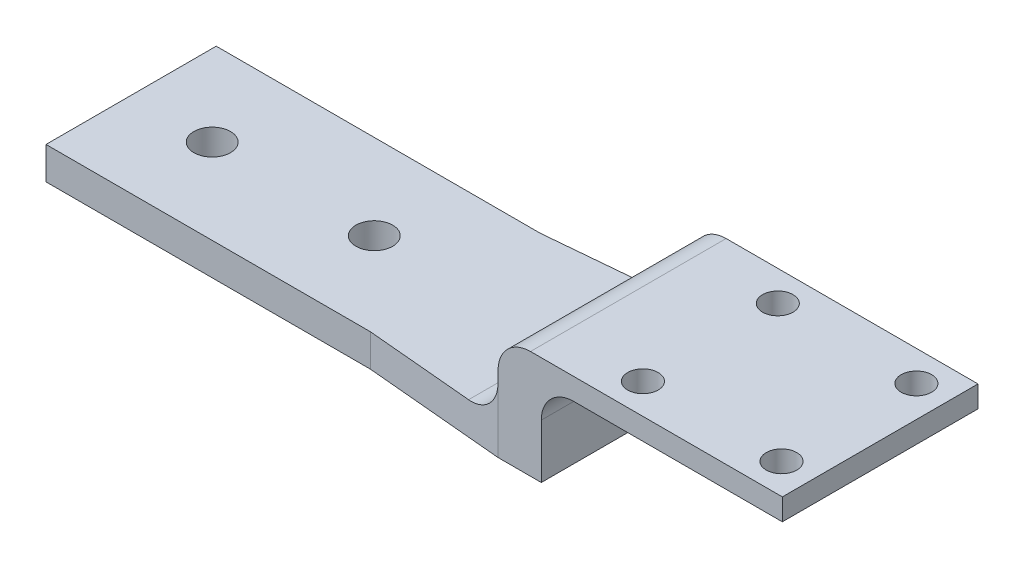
ISO-10303-21;
HEADER;
FILE_DESCRIPTION(('STEP AP214'),'2;1');
FILE_NAME('part.step','',(''),(''),'','','');
FILE_SCHEMA(('AUTOMOTIVE_DESIGN { 1 0 10303 214 1 1 1 1 }'));
ENDSEC;
DATA;
#1=APPLICATION_CONTEXT('core data for automotive mechanical design processes');
#2=APPLICATION_PROTOCOL_DEFINITION('international standard','automotive_design',2000,#1);
#3=PRODUCT_CONTEXT('',#1,'mechanical');
#4=PRODUCT('Part','Part','',(#3));
#5=PRODUCT_RELATED_PRODUCT_CATEGORY('part','',(#4));
#6=PRODUCT_DEFINITION_FORMATION('','',#4);
#7=PRODUCT_DEFINITION_CONTEXT('part definition',#1,'design');
#8=PRODUCT_DEFINITION('design','',#6,#7);
#9=PRODUCT_DEFINITION_SHAPE('','',#8);
#10=(LENGTH_UNIT() NAMED_UNIT(*) SI_UNIT(.MILLI.,.METRE.));
#11=(NAMED_UNIT(*) PLANE_ANGLE_UNIT() SI_UNIT($,.RADIAN.));
#12=(NAMED_UNIT(*) SI_UNIT($,.STERADIAN.) SOLID_ANGLE_UNIT());
#13=UNCERTAINTY_MEASURE_WITH_UNIT(LENGTH_MEASURE(1.E-05),#10,'distance_accuracy_value','');
#14=(GEOMETRIC_REPRESENTATION_CONTEXT(3) GLOBAL_UNCERTAINTY_ASSIGNED_CONTEXT((#13)) GLOBAL_UNIT_ASSIGNED_CONTEXT((#10,
#11,#12)) REPRESENTATION_CONTEXT('',''));
#15=CARTESIAN_POINT('',(0.,0.,0.));
#16=DIRECTION('',(0.,0.,1.));
#17=DIRECTION('',(1.,0.,0.));
#18=AXIS2_PLACEMENT_3D('',#15,#16,#17);
#19=CARTESIAN_POINT('',(59.69,1.905,0.));
#20=DIRECTION('',(1.,0.,0.));
#21=DIRECTION('',(0.,0.,-1.));
#22=AXIS2_PLACEMENT_3D('',#19,#20,#21);
#23=PLANE('',#22);
#24=DIRECTION('',(0.,-1.,0.));
#25=VECTOR('',#24,1.);
#26=CARTESIAN_POINT('',(59.69,1.90499999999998,-21.4935));
#27=LINE('',#26,#25);
#28=CARTESIAN_POINT('',(59.69,4.445,-21.4935));
#29=VERTEX_POINT('',#28);
#30=CARTESIAN_POINT('',(59.69,-1.90500000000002,-21.4935));
#31=VERTEX_POINT('',#30);
#32=EDGE_CURVE('E236',#29,#31,#27,.T.);
#33=ORIENTED_EDGE('',*,*,#32,.F.);
#34=DIRECTION('',(0.,0.,1.));
#35=VECTOR('',#34,1.);
#36=CARTESIAN_POINT('',(59.69,4.445,0.));
#37=LINE('',#36,#35);
#38=CARTESIAN_POINT('',(59.69,4.445,1.4935));
#39=VERTEX_POINT('',#38);
#40=EDGE_CURVE('E309',#29,#39,#37,.T.);
#41=ORIENTED_EDGE('',*,*,#40,.T.);
#42=DIRECTION('',(0.,-1.,0.));
#43=VECTOR('',#42,1.);
#44=CARTESIAN_POINT('',(59.69,1.90500000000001,1.4935));
#45=LINE('',#44,#43);
#46=CARTESIAN_POINT('',(59.69,-1.90499999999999,1.49350000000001));
#47=VERTEX_POINT('',#46);
#48=EDGE_CURVE('E233',#39,#47,#45,.T.);
#49=ORIENTED_EDGE('',*,*,#48,.T.);
#50=DIRECTION('',(0.,0.,1.));
#51=VECTOR('',#50,1.);
#52=CARTESIAN_POINT('',(59.69,-1.90499999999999,0.));
#53=LINE('',#52,#51);
#54=EDGE_CURVE('E223',#31,#47,#53,.T.);
#55=ORIENTED_EDGE('',*,*,#54,.F.);
#56=EDGE_LOOP('',(#33,#41,#49,#55));
#57=FACE_BOUND('',#56,.T.);
#58=ADVANCED_FACE('F45',(#57),#23,.T.);
#59=CARTESIAN_POINT('',(38.1,1.905,-20.));
#60=DIRECTION('',(0.,0.,-1.));
#61=DIRECTION('',(0.,1.,0.));
#62=AXIS2_PLACEMENT_3D('',#59,#60,#61);
#63=PLANE('',#62);
#64=DIRECTION('',(0.,-1.,0.));
#65=VECTOR('',#64,1.);
#66=CARTESIAN_POINT('',(0.,1.905,-20.));
#67=LINE('',#66,#65);
#68=CARTESIAN_POINT('',(0.,1.905,-20.));
#69=VERTEX_POINT('',#68);
#70=CARTESIAN_POINT('',(0.,-1.905,-20.));
#71=VERTEX_POINT('',#70);
#72=EDGE_CURVE('E255',#69,#71,#67,.T.);
#73=ORIENTED_EDGE('',*,*,#72,.F.);
#74=DIRECTION('',(-1.,0.,0.));
#75=VECTOR('',#74,1.);
#76=CARTESIAN_POINT('',(38.1,1.905,-20.));
#77=LINE('',#76,#75);
#78=CARTESIAN_POINT('',(38.1,1.905,-20.));
#79=VERTEX_POINT('',#78);
#80=EDGE_CURVE('E280',#79,#69,#77,.T.);
#81=ORIENTED_EDGE('',*,*,#80,.F.);
#82=DIRECTION('',(0.,-1.,0.));
#83=VECTOR('',#82,1.);
#84=CARTESIAN_POINT('',(38.1,1.905,-20.));
#85=LINE('',#84,#83);
#86=CARTESIAN_POINT('',(38.1,-1.905,-20.));
#87=VERTEX_POINT('',#86);
#88=EDGE_CURVE('E254',#79,#87,#85,.T.);
#89=ORIENTED_EDGE('',*,*,#88,.T.);
#90=DIRECTION('',(-1.,0.,0.));
#91=VECTOR('',#90,1.);
#92=CARTESIAN_POINT('',(38.1,-1.905,-20.));
#93=LINE('',#92,#91);
#94=EDGE_CURVE('E275',#87,#71,#93,.T.);
#95=ORIENTED_EDGE('',*,*,#94,.T.);
#96=EDGE_LOOP('',(#73,#81,#89,#95));
#97=FACE_BOUND('',#96,.T.);
#98=ADVANCED_FACE('F362',(#97),#63,.T.);
#99=CARTESIAN_POINT('',(38.1,1.905,0.));
#100=DIRECTION('',(0.,1.,0.));
#101=DIRECTION('',(0.,0.,1.));
#102=AXIS2_PLACEMENT_3D('',#99,#100,#101);
#103=PLANE('',#102);
#104=DIRECTION('',(0.995933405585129,0.,0.0900924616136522));
#105=VECTOR('',#104,1.);
#106=CARTESIAN_POINT('',(0.309244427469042,1.905,-3.41856410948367));
#107=LINE('',#106,#105);
#108=CARTESIAN_POINT('',(38.1,1.905,0.));
#109=VERTEX_POINT('',#108);
#110=CARTESIAN_POINT('',(50.8,1.90500000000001,1.14884615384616));
#111=VERTEX_POINT('',#110);
#112=EDGE_CURVE('E205',#109,#111,#107,.T.);
#113=ORIENTED_EDGE('',*,*,#112,.T.);
#114=DIRECTION('',(0.,0.,1.));
#115=VECTOR('',#114,1.);
#116=CARTESIAN_POINT('',(50.8,1.905,0.));
#117=LINE('',#116,#115);
#118=CARTESIAN_POINT('',(50.8,1.90499999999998,-21.1488461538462));
#119=VERTEX_POINT('',#118);
#120=EDGE_CURVE('E332',#111,#119,#117,.F.);
#121=ORIENTED_EDGE('',*,*,#120,.T.);
#122=DIRECTION('',(0.995933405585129,0.,-0.0900924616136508));
#123=VECTOR('',#122,1.);
#124=CARTESIAN_POINT('',(-1.48527741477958,1.90499999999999,-16.4191028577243));
#125=LINE('',#124,#123);
#126=EDGE_CURVE('E208',#79,#119,#125,.T.);
#127=ORIENTED_EDGE('',*,*,#126,.F.);
#128=ORIENTED_EDGE('',*,*,#80,.T.);
#129=DIRECTION('',(0.,0.,-1.));
#130=VECTOR('',#129,1.);
#131=CARTESIAN_POINT('',(0.,1.905,0.));
#132=LINE('',#131,#130);
#133=CARTESIAN_POINT('',(0.,1.905,0.));
#134=VERTEX_POINT('',#133);
#135=EDGE_CURVE('E268',#134,#69,#132,.T.);
#136=ORIENTED_EDGE('',*,*,#135,.F.);
#137=DIRECTION('',(-1.,0.,0.));
#138=VECTOR('',#137,1.);
#139=CARTESIAN_POINT('',(38.1,1.905,0.));
#140=LINE('',#139,#138);
#141=EDGE_CURVE('E283',#109,#134,#140,.T.);
#142=ORIENTED_EDGE('',*,*,#141,.F.);
#143=EDGE_LOOP('',(#113,#121,#127,#128,#136,#142));
#144=FACE_BOUND('',#143,.T.);
#145=CARTESIAN_POINT('',(28.575,1.905,-10.));
#146=DIRECTION('',(0.,1.,0.));
#147=DIRECTION('',(0.,0.,1.));
#148=AXIS2_PLACEMENT_3D('',#145,#146,#147);
#149=CIRCLE('',#148,2.15702401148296);
#150=CARTESIAN_POINT('',(28.575,1.905,-7.84297598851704));
#151=VERTEX_POINT('',#150);
#152=EDGE_CURVE('E244',#151,#151,#149,.T.);
#153=ORIENTED_EDGE('',*,*,#152,.F.);
#154=EDGE_LOOP('',(#153));
#155=FACE_BOUND('',#154,.T.);
#156=CARTESIAN_POINT('',(9.525,1.905,-10.));
#157=DIRECTION('',(0.,1.,0.));
#158=DIRECTION('',(0.,0.,1.));
#159=AXIS2_PLACEMENT_3D('',#156,#157,#158);
#160=CIRCLE('',#159,2.15702401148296);
#161=CARTESIAN_POINT('',(9.525,1.905,-7.84297598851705));
#162=VERTEX_POINT('',#161);
#163=EDGE_CURVE('E249',#162,#162,#160,.T.);
#164=ORIENTED_EDGE('',*,*,#163,.F.);
#165=EDGE_LOOP('',(#164));
#166=FACE_BOUND('',#165,.T.);
#167=ADVANCED_FACE('F367',(#144,#155,#166),#103,.T.);
#168=CARTESIAN_POINT('',(38.1,1.905,0.));
#169=DIRECTION('',(0.,0.,-1.));
#170=DIRECTION('',(0.,1.,0.));
#171=AXIS2_PLACEMENT_3D('',#168,#169,#170);
#172=PLANE('',#171);
#173=DIRECTION('',(0.,-1.,0.));
#174=VECTOR('',#173,1.);
#175=CARTESIAN_POINT('',(0.,1.905,0.));
#176=LINE('',#175,#174);
#177=CARTESIAN_POINT('',(0.,-1.90499999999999,0.));
#178=VERTEX_POINT('',#177);
#179=EDGE_CURVE('E264',#134,#178,#176,.T.);
#180=ORIENTED_EDGE('',*,*,#179,.T.);
#181=DIRECTION('',(-1.,0.,0.));
#182=VECTOR('',#181,1.);
#183=CARTESIAN_POINT('',(38.1,-1.90499999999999,0.));
#184=LINE('',#183,#182);
#185=CARTESIAN_POINT('',(38.1,-1.90499999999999,0.));
#186=VERTEX_POINT('',#185);
#187=EDGE_CURVE('E259',#186,#178,#184,.T.);
#188=ORIENTED_EDGE('',*,*,#187,.F.);
#189=DIRECTION('',(0.,-1.,0.));
#190=VECTOR('',#189,1.);
#191=CARTESIAN_POINT('',(38.1,1.905,0.));
#192=LINE('',#191,#190);
#193=EDGE_CURVE('E250',#109,#186,#192,.T.);
#194=ORIENTED_EDGE('',*,*,#193,.F.);
#195=ORIENTED_EDGE('',*,*,#141,.T.);
#196=EDGE_LOOP('',(#180,#188,#194,#195));
#197=FACE_BOUND('',#196,.T.);
#198=ADVANCED_FACE('F408',(#197),#172,.F.);
#199=CARTESIAN_POINT('',(38.1,-1.905,-4.91999999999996));
#200=DIRECTION('',(0.,-1.,0.));
#201=DIRECTION('',(0.,0.,-1.));
#202=AXIS2_PLACEMENT_3D('',#199,#200,#201);
#203=PLANE('',#202);
#204=CARTESIAN_POINT('',(9.525,-1.90500000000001,-10.));
#205=DIRECTION('',(0.,-1.,0.));
#206=DIRECTION('',(0.,0.,-1.));
#207=AXIS2_PLACEMENT_3D('',#204,#205,#206);
#208=CIRCLE('',#207,3.21475100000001);
#209=CARTESIAN_POINT('',(9.525,-1.90500000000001,-13.214751));
#210=VERTEX_POINT('',#209);
#211=EDGE_CURVE('E301',#210,#210,#208,.F.);
#212=ORIENTED_EDGE('',*,*,#211,.T.);
#213=EDGE_LOOP('',(#212));
#214=FACE_BOUND('',#213,.T.);
#215=CARTESIAN_POINT('',(28.575,-1.90500000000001,-10.));
#216=DIRECTION('',(0.,-1.,0.));
#217=DIRECTION('',(0.,0.,-1.));
#218=AXIS2_PLACEMENT_3D('',#215,#216,#217);
#219=CIRCLE('',#218,3.21475100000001);
#220=CARTESIAN_POINT('',(28.575,-1.90500000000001,-13.214751));
#221=VERTEX_POINT('',#220);
#222=EDGE_CURVE('E297',#221,#221,#219,.F.);
#223=ORIENTED_EDGE('',*,*,#222,.T.);
#224=EDGE_LOOP('',(#223));
#225=FACE_BOUND('',#224,.T.);
#226=DIRECTION('',(0.,0.,1.));
#227=VECTOR('',#226,1.);
#228=CARTESIAN_POINT('',(0.,-1.905,-4.91999999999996));
#229=LINE('',#228,#227);
#230=EDGE_CURVE('E260',#71,#178,#229,.T.);
#231=ORIENTED_EDGE('',*,*,#230,.F.);
#232=ORIENTED_EDGE('',*,*,#94,.F.);
#233=DIRECTION('',(0.995933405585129,0.,-0.0900924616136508));
#234=VECTOR('',#233,1.);
#235=CARTESIAN_POINT('',(-1.48527741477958,-1.90500000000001,-16.4191028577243));
#236=LINE('',#235,#234);
#237=CARTESIAN_POINT('',(54.61,-1.90500000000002,-21.4935));
#238=VERTEX_POINT('',#237);
#239=EDGE_CURVE('E215',#87,#238,#236,.T.);
#240=ORIENTED_EDGE('',*,*,#239,.T.);
#241=DIRECTION('',(1.,0.,0.));
#242=VECTOR('',#241,1.);
#243=CARTESIAN_POINT('',(0.,-1.90500000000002,-21.4935));
#244=LINE('',#243,#242);
#245=EDGE_CURVE('E219',#238,#31,#244,.T.);
#246=ORIENTED_EDGE('',*,*,#245,.T.);
#247=ORIENTED_EDGE('',*,*,#54,.T.);
#248=DIRECTION('',(-1.,0.,0.));
#249=VECTOR('',#248,1.);
#250=CARTESIAN_POINT('',(0.,-1.90499999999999,1.49350000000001));
#251=LINE('',#250,#249);
#252=CARTESIAN_POINT('',(54.61,-1.90499999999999,1.49350000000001));
#253=VERTEX_POINT('',#252);
#254=EDGE_CURVE('E209',#47,#253,#251,.T.);
#255=ORIENTED_EDGE('',*,*,#254,.T.);
#256=DIRECTION('',(0.995933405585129,0.,0.0900924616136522));
#257=VECTOR('',#256,1.);
#258=CARTESIAN_POINT('',(0.309244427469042,-1.905,-3.41856410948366));
#259=LINE('',#258,#257);
#260=EDGE_CURVE('E204',#186,#253,#259,.T.);
#261=ORIENTED_EDGE('',*,*,#260,.F.);
#262=ORIENTED_EDGE('',*,*,#187,.T.);
#263=EDGE_LOOP('',(#231,#232,#240,#246,#247,#255,#261,#262));
#264=FACE_BOUND('',#263,.T.);
#265=ADVANCED_FACE('F403',(#214,#225,#264),#203,.T.);
#266=CARTESIAN_POINT('',(0.,0.,0.));
#267=DIRECTION('',(1.,0.,0.));
#268=DIRECTION('',(0.,0.,-1.));
#269=AXIS2_PLACEMENT_3D('',#266,#267,#268);
#270=PLANE('',#269);
#271=ORIENTED_EDGE('',*,*,#72,.T.);
#272=ORIENTED_EDGE('',*,*,#230,.T.);
#273=ORIENTED_EDGE('',*,*,#179,.F.);
#274=ORIENTED_EDGE('',*,*,#135,.T.);
#275=EDGE_LOOP('',(#271,#272,#273,#274));
#276=FACE_BOUND('',#275,.T.);
#277=ADVANCED_FACE('F400',(#276),#270,.F.);
#278=CARTESIAN_POINT('',(9.525,1.65099999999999,-10.));
#279=DIRECTION('',(0.,-1.,0.));
#280=DIRECTION('',(0.,0.,-1.));
#281=AXIS2_PLACEMENT_3D('',#278,#279,#280);
#282=CONICAL_SURFACE('',#281,2.579751,1.02974425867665);
#283=ORIENTED_EDGE('',*,*,#163,.T.);
#284=EDGE_LOOP('',(#283));
#285=FACE_BOUND('',#284,.T.);
#286=CARTESIAN_POINT('',(9.525,1.65099999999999,-10.));
#287=DIRECTION('',(0.,-1.,0.));
#288=DIRECTION('',(0.,0.,-1.));
#289=AXIS2_PLACEMENT_3D('',#286,#287,#288);
#290=CIRCLE('',#289,2.579751);
#291=CARTESIAN_POINT('',(9.525,1.65099999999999,-12.579751));
#292=VERTEX_POINT('',#291);
#293=EDGE_CURVE('E245',#292,#292,#290,.T.);
#294=ORIENTED_EDGE('',*,*,#293,.T.);
#295=EDGE_LOOP('',(#294));
#296=FACE_BOUND('',#295,.T.);
#297=ADVANCED_FACE('F396',(#285,#296),#282,.F.);
#298=CARTESIAN_POINT('',(9.525,-1.90500000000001,-10.));
#299=DIRECTION('',(0.,-1.,0.));
#300=DIRECTION('',(0.,0.,-1.));
#301=AXIS2_PLACEMENT_3D('',#298,#299,#300);
#302=CYLINDRICAL_SURFACE('',#301,2.579751);
#303=CARTESIAN_POINT('',(9.525,-1.53838257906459,-10.));
#304=DIRECTION('',(0.,-1.,0.));
#305=DIRECTION('',(0.,0.,-1.));
#306=AXIS2_PLACEMENT_3D('',#303,#304,#305);
#307=CIRCLE('',#306,2.579751);
#308=CARTESIAN_POINT('',(9.525,-1.53838257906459,-12.579751));
#309=VERTEX_POINT('',#308);
#310=EDGE_CURVE('E279',#309,#309,#307,.T.);
#311=ORIENTED_EDGE('',*,*,#310,.T.);
#312=EDGE_LOOP('',(#311));
#313=FACE_BOUND('',#312,.T.);
#314=ORIENTED_EDGE('',*,*,#293,.F.);
#315=EDGE_LOOP('',(#314));
#316=FACE_BOUND('',#315,.T.);
#317=ADVANCED_FACE('F392',(#313,#316),#302,.F.);
#318=CARTESIAN_POINT('',(28.575,1.65099999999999,-10.));
#319=DIRECTION('',(0.,-1.,0.));
#320=DIRECTION('',(0.,0.,-1.));
#321=AXIS2_PLACEMENT_3D('',#318,#319,#320);
#322=CONICAL_SURFACE('',#321,2.579751,1.02974425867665);
#323=ORIENTED_EDGE('',*,*,#152,.T.);
#324=EDGE_LOOP('',(#323));
#325=FACE_BOUND('',#324,.T.);
#326=CARTESIAN_POINT('',(28.575,1.65099999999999,-10.));
#327=DIRECTION('',(0.,-1.,0.));
#328=DIRECTION('',(0.,0.,-1.));
#329=AXIS2_PLACEMENT_3D('',#326,#327,#328);
#330=CIRCLE('',#329,2.579751);
#331=CARTESIAN_POINT('',(28.575,1.65099999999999,-12.579751));
#332=VERTEX_POINT('',#331);
#333=EDGE_CURVE('E232',#332,#332,#330,.T.);
#334=ORIENTED_EDGE('',*,*,#333,.T.);
#335=EDGE_LOOP('',(#334));
#336=FACE_BOUND('',#335,.T.);
#337=ADVANCED_FACE('F388',(#325,#336),#322,.F.);
#338=CARTESIAN_POINT('',(28.575,-1.90500000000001,-10.));
#339=DIRECTION('',(0.,-1.,0.));
#340=DIRECTION('',(0.,0.,-1.));
#341=AXIS2_PLACEMENT_3D('',#338,#339,#340);
#342=CYLINDRICAL_SURFACE('',#341,2.579751);
#343=CARTESIAN_POINT('',(28.575,-1.53838257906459,-10.));
#344=DIRECTION('',(0.,-1.,0.));
#345=DIRECTION('',(0.,0.,-1.));
#346=AXIS2_PLACEMENT_3D('',#343,#344,#345);
#347=CIRCLE('',#346,2.579751);
#348=CARTESIAN_POINT('',(28.575,-1.53838257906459,-12.579751));
#349=VERTEX_POINT('',#348);
#350=EDGE_CURVE('E305',#349,#349,#347,.T.);
#351=ORIENTED_EDGE('',*,*,#350,.T.);
#352=EDGE_LOOP('',(#351));
#353=FACE_BOUND('',#352,.T.);
#354=ORIENTED_EDGE('',*,*,#333,.F.);
#355=EDGE_LOOP('',(#354));
#356=FACE_BOUND('',#355,.T.);
#357=ADVANCED_FACE('F384',(#353,#356),#342,.F.);
#358=CARTESIAN_POINT('',(9.525,-1.53838257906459,-10.));
#359=DIRECTION('',(0.,-1.,0.));
#360=DIRECTION('',(0.,0.,-1.));
#361=AXIS2_PLACEMENT_3D('',#358,#359,#360);
#362=CONICAL_SURFACE('',#361,2.579751,1.0471975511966);
#363=ORIENTED_EDGE('',*,*,#211,.F.);
#364=EDGE_LOOP('',(#363));
#365=FACE_BOUND('',#364,.T.);
#366=ORIENTED_EDGE('',*,*,#310,.F.);
#367=EDGE_LOOP('',(#366));
#368=FACE_BOUND('',#367,.T.);
#369=ADVANCED_FACE('F387',(#365,#368),#362,.F.);
#370=CARTESIAN_POINT('',(28.575,-1.53838257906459,-10.));
#371=DIRECTION('',(0.,-1.,0.));
#372=DIRECTION('',(0.,0.,-1.));
#373=AXIS2_PLACEMENT_3D('',#370,#371,#372);
#374=CONICAL_SURFACE('',#373,2.579751,1.0471975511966);
#375=ORIENTED_EDGE('',*,*,#222,.F.);
#376=EDGE_LOOP('',(#375));
#377=FACE_BOUND('',#376,.T.);
#378=ORIENTED_EDGE('',*,*,#350,.F.);
#379=EDGE_LOOP('',(#378));
#380=FACE_BOUND('',#379,.T.);
#381=ADVANCED_FACE('F383',(#377,#380),#374,.F.);
#382=CARTESIAN_POINT('',(0.309244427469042,1.905,-3.41856410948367));
#383=DIRECTION('',(0.0900924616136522,0.,-0.995933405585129));
#384=DIRECTION('',(-0.995933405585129,0.,-0.0900924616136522));
#385=AXIS2_PLACEMENT_3D('',#382,#383,#384);
#386=PLANE('',#385);
#387=ORIENTED_EDGE('',*,*,#260,.T.);
#388=DIRECTION('',(0.,-1.,0.));
#389=VECTOR('',#388,1.);
#390=CARTESIAN_POINT('',(54.61,1.90500000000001,1.4935));
#391=LINE('',#390,#389);
#392=CARTESIAN_POINT('',(54.61,5.715,1.4935));
#393=VERTEX_POINT('',#392);
#394=EDGE_CURVE('E79',#393,#253,#391,.T.);
#395=ORIENTED_EDGE('',*,*,#394,.F.);
#396=CARTESIAN_POINT('',(50.8,5.715,1.14884615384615));
#397=DIRECTION('',(0.0900924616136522,0.,-0.995933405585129));
#398=DIRECTION('',(0.995933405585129,0.,0.0900924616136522));
#399=AXIS2_PLACEMENT_3D('',#396,#397,#398);
#400=ELLIPSE('',#399,3.82555698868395,3.81);
#401=EDGE_CURVE('E54',#393,#111,#400,.T.);
#402=ORIENTED_EDGE('',*,*,#401,.T.);
#403=ORIENTED_EDGE('',*,*,#112,.F.);
#404=ORIENTED_EDGE('',*,*,#193,.T.);
#405=EDGE_LOOP('',(#387,#395,#402,#403,#404));
#406=FACE_BOUND('',#405,.T.);
#407=ADVANCED_FACE('F380',(#406),#386,.F.);
#408=CARTESIAN_POINT('',(0.,1.90500000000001,1.49350000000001));
#409=DIRECTION('',(0.,0.,1.));
#410=DIRECTION('',(0.,-1.,0.));
#411=AXIS2_PLACEMENT_3D('',#408,#409,#410);
#412=PLANE('',#411);
#413=DIRECTION('',(1.,0.,0.));
#414=VECTOR('',#413,1.);
#415=CARTESIAN_POINT('',(59.69,10.795,1.4935));
#416=LINE('',#415,#414);
#417=CARTESIAN_POINT('',(58.42,10.795,1.4935));
#418=VERTEX_POINT('',#417);
#419=CARTESIAN_POINT('',(88.011,10.795,1.4935));
#420=VERTEX_POINT('',#419);
#421=EDGE_CURVE('E195',#418,#420,#416,.T.);
#422=ORIENTED_EDGE('',*,*,#421,.F.);
#423=CARTESIAN_POINT('',(58.42,6.985,1.4935));
#424=DIRECTION('',(0.,0.,1.));
#425=DIRECTION('',(0.,-1.,0.));
#426=AXIS2_PLACEMENT_3D('',#423,#424,#425);
#427=CIRCLE('',#426,3.81);
#428=CARTESIAN_POINT('',(54.61,6.985,1.4935));
#429=VERTEX_POINT('',#428);
#430=EDGE_CURVE('E88',#418,#429,#427,.T.);
#431=ORIENTED_EDGE('',*,*,#430,.T.);
#432=DIRECTION('',(0.,-1.,0.));
#433=VECTOR('',#432,1.);
#434=CARTESIAN_POINT('',(54.61,10.795,1.4935));
#435=LINE('',#434,#433);
#436=EDGE_CURVE('E198',#429,#393,#435,.T.);
#437=ORIENTED_EDGE('',*,*,#436,.T.);
#438=ORIENTED_EDGE('',*,*,#394,.T.);
#439=ORIENTED_EDGE('',*,*,#254,.F.);
#440=ORIENTED_EDGE('',*,*,#48,.F.);
#441=CARTESIAN_POINT('',(63.5,4.445,1.4935));
#442=DIRECTION('',(0.,0.,1.));
#443=DIRECTION('',(0.,-1.,0.));
#444=AXIS2_PLACEMENT_3D('',#441,#442,#443);
#445=CIRCLE('',#444,3.81);
#446=CARTESIAN_POINT('',(63.5,8.255,1.4935));
#447=VERTEX_POINT('',#446);
#448=EDGE_CURVE('E160',#39,#447,#445,.F.);
#449=ORIENTED_EDGE('',*,*,#448,.T.);
#450=DIRECTION('',(1.,0.,0.));
#451=VECTOR('',#450,1.);
#452=CARTESIAN_POINT('',(59.69,8.255,1.4935));
#453=LINE('',#452,#451);
#454=CARTESIAN_POINT('',(88.011,8.255,1.4935));
#455=VERTEX_POINT('',#454);
#456=EDGE_CURVE('E154',#447,#455,#453,.T.);
#457=ORIENTED_EDGE('',*,*,#456,.T.);
#458=DIRECTION('',(0.,1.,0.));
#459=VECTOR('',#458,1.);
#460=CARTESIAN_POINT('',(88.011,8.255,1.4935));
#461=LINE('',#460,#459);
#462=EDGE_CURVE('E157',#455,#420,#461,.T.);
#463=ORIENTED_EDGE('',*,*,#462,.T.);
#464=EDGE_LOOP('',(#422,#431,#437,#438,#439,#440,#449,#457,#463));
#465=FACE_BOUND('',#464,.T.);
#466=ADVANCED_FACE('F156',(#465),#412,.T.);
#467=CARTESIAN_POINT('',(0.,1.90499999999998,-21.4935));
#468=DIRECTION('',(0.,0.,-1.));
#469=DIRECTION('',(0.,1.,0.));
#470=AXIS2_PLACEMENT_3D('',#467,#468,#469);
#471=PLANE('',#470);
#472=DIRECTION('',(0.,-1.,0.));
#473=VECTOR('',#472,1.);
#474=CARTESIAN_POINT('',(54.61,10.795,-21.4935));
#475=LINE('',#474,#473);
#476=CARTESIAN_POINT('',(54.61,6.985,-21.4935));
#477=VERTEX_POINT('',#476);
#478=CARTESIAN_POINT('',(54.61,5.715,-21.4935));
#479=VERTEX_POINT('',#478);
#480=EDGE_CURVE('E201',#477,#479,#475,.T.);
#481=ORIENTED_EDGE('',*,*,#480,.F.);
#482=CARTESIAN_POINT('',(58.42,6.985,-21.4935));
#483=DIRECTION('',(0.,0.,-1.));
#484=DIRECTION('',(0.,1.,0.));
#485=AXIS2_PLACEMENT_3D('',#482,#483,#484);
#486=CIRCLE('',#485,3.81);
#487=CARTESIAN_POINT('',(58.42,10.795,-21.4935));
#488=VERTEX_POINT('',#487);
#489=EDGE_CURVE('E329',#477,#488,#486,.T.);
#490=ORIENTED_EDGE('',*,*,#489,.T.);
#491=DIRECTION('',(-1.,0.,0.));
#492=VECTOR('',#491,1.);
#493=CARTESIAN_POINT('',(59.69,10.795,-21.4935));
#494=LINE('',#493,#492);
#495=CARTESIAN_POINT('',(88.011,10.795,-21.4935));
#496=VERTEX_POINT('',#495);
#497=EDGE_CURVE('E190',#496,#488,#494,.T.);
#498=ORIENTED_EDGE('',*,*,#497,.F.);
#499=DIRECTION('',(0.,1.,0.));
#500=VECTOR('',#499,1.);
#501=CARTESIAN_POINT('',(88.011,8.255,-21.4935));
#502=LINE('',#501,#500);
#503=CARTESIAN_POINT('',(88.011,8.255,-21.4935));
#504=VERTEX_POINT('',#503);
#505=EDGE_CURVE('E174',#504,#496,#502,.T.);
#506=ORIENTED_EDGE('',*,*,#505,.F.);
#507=DIRECTION('',(-1.,0.,0.));
#508=VECTOR('',#507,1.);
#509=CARTESIAN_POINT('',(64.389,8.255,-21.4935));
#510=LINE('',#509,#508);
#511=CARTESIAN_POINT('',(63.5,8.255,-21.4935));
#512=VERTEX_POINT('',#511);
#513=EDGE_CURVE('E175',#504,#512,#510,.T.);
#514=ORIENTED_EDGE('',*,*,#513,.T.);
#515=CARTESIAN_POINT('',(63.5,4.445,-21.4935));
#516=DIRECTION('',(0.,0.,-1.));
#517=DIRECTION('',(0.,1.,0.));
#518=AXIS2_PLACEMENT_3D('',#515,#516,#517);
#519=CIRCLE('',#518,3.81);
#520=EDGE_CURVE('E337',#512,#29,#519,.F.);
#521=ORIENTED_EDGE('',*,*,#520,.T.);
#522=ORIENTED_EDGE('',*,*,#32,.T.);
#523=ORIENTED_EDGE('',*,*,#245,.F.);
#524=DIRECTION('',(0.,-1.,0.));
#525=VECTOR('',#524,1.);
#526=CARTESIAN_POINT('',(54.61,1.90499999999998,-21.4935));
#527=LINE('',#526,#525);
#528=EDGE_CURVE('E61',#479,#238,#527,.T.);
#529=ORIENTED_EDGE('',*,*,#528,.F.);
#530=EDGE_LOOP('',(#481,#490,#498,#506,#514,#521,#522,#523,#529));
#531=FACE_BOUND('',#530,.T.);
#532=ADVANCED_FACE('F342',(#531),#471,.T.);
#533=CARTESIAN_POINT('',(-1.48527741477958,1.90499999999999,-16.4191028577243));
#534=DIRECTION('',(-0.0900924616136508,0.,-0.995933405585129));
#535=DIRECTION('',(-0.995933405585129,0.,0.0900924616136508));
#536=AXIS2_PLACEMENT_3D('',#533,#534,#535);
#537=PLANE('',#536);
#538=ORIENTED_EDGE('',*,*,#239,.F.);
#539=ORIENTED_EDGE('',*,*,#88,.F.);
#540=ORIENTED_EDGE('',*,*,#126,.T.);
#541=CARTESIAN_POINT('',(50.8,5.715,-21.1488461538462));
#542=DIRECTION('',(-0.0900924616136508,0.,-0.995933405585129));
#543=DIRECTION('',(-0.995933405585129,0.,0.0900924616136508));
#544=AXIS2_PLACEMENT_3D('',#541,#542,#543);
#545=ELLIPSE('',#544,3.82555698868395,3.81);
#546=EDGE_CURVE('E11',#119,#479,#545,.F.);
#547=ORIENTED_EDGE('',*,*,#546,.T.);
#548=ORIENTED_EDGE('',*,*,#528,.T.);
#549=EDGE_LOOP('',(#538,#539,#540,#547,#548));
#550=FACE_BOUND('',#549,.T.);
#551=ADVANCED_FACE('F375',(#550),#537,.T.);
#552=CARTESIAN_POINT('',(54.61,10.795,-21.4935));
#553=DIRECTION('',(1.,0.,0.));
#554=DIRECTION('',(0.,0.,-1.));
#555=AXIS2_PLACEMENT_3D('',#552,#553,#554);
#556=PLANE('',#555);
#557=ORIENTED_EDGE('',*,*,#436,.F.);
#558=DIRECTION('',(0.,0.,1.));
#559=VECTOR('',#558,1.);
#560=CARTESIAN_POINT('',(54.61,6.985,-21.4935));
#561=LINE('',#560,#559);
#562=EDGE_CURVE('E326',#429,#477,#561,.F.);
#563=ORIENTED_EDGE('',*,*,#562,.T.);
#564=ORIENTED_EDGE('',*,*,#480,.T.);
#565=DIRECTION('',(0.,0.,1.));
#566=VECTOR('',#565,1.);
#567=CARTESIAN_POINT('',(54.61,5.715,-21.4935));
#568=LINE('',#567,#566);
#569=EDGE_CURVE('E322',#479,#393,#568,.T.);
#570=ORIENTED_EDGE('',*,*,#569,.T.);
#571=EDGE_LOOP('',(#557,#563,#564,#570));
#572=FACE_BOUND('',#571,.T.);
#573=ADVANCED_FACE('F378',(#572),#556,.F.);
#574=CARTESIAN_POINT('',(0.,10.795,0.));
#575=DIRECTION('',(0.,-1.,0.));
#576=DIRECTION('',(0.,0.,-1.));
#577=AXIS2_PLACEMENT_3D('',#574,#575,#576);
#578=PLANE('',#577);
#579=ORIENTED_EDGE('',*,*,#497,.T.);
#580=DIRECTION('',(0.,0.,1.));
#581=VECTOR('',#580,1.);
#582=CARTESIAN_POINT('',(58.42,10.795,0.));
#583=LINE('',#582,#581);
#584=EDGE_CURVE('E316',#488,#418,#583,.T.);
#585=ORIENTED_EDGE('',*,*,#584,.T.);
#586=ORIENTED_EDGE('',*,*,#421,.T.);
#587=DIRECTION('',(0.,0.,-1.));
#588=VECTOR('',#587,1.);
#589=CARTESIAN_POINT('',(88.011,10.795,1.4935));
#590=LINE('',#589,#588);
#591=EDGE_CURVE('E166',#420,#496,#590,.T.);
#592=ORIENTED_EDGE('',*,*,#591,.T.);
#593=EDGE_LOOP('',(#579,#585,#586,#592));
#594=FACE_BOUND('',#593,.T.);
#595=CARTESIAN_POINT('',(68.0562828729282,10.795,-2.0752));
#596=DIRECTION('',(0.,1.,0.));
#597=DIRECTION('',(0.,0.,1.));
#598=AXIS2_PLACEMENT_3D('',#595,#596,#597);
#599=CIRCLE('',#598,1.79070000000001);
#600=CARTESIAN_POINT('',(68.0562828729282,10.795,-0.284499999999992));
#601=VERTEX_POINT('',#600);
#602=EDGE_CURVE('E462',#601,#601,#599,.T.);
#603=ORIENTED_EDGE('',*,*,#602,.F.);
#604=EDGE_LOOP('',(#603));
#605=FACE_BOUND('',#604,.T.);
#606=CARTESIAN_POINT('',(84.3437171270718,10.795,-2.0752));
#607=DIRECTION('',(0.,1.,0.));
#608=DIRECTION('',(0.,0.,1.));
#609=AXIS2_PLACEMENT_3D('',#606,#607,#608);
#610=CIRCLE('',#609,1.79070000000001);
#611=CARTESIAN_POINT('',(84.3437171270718,10.795,-0.284499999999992));
#612=VERTEX_POINT('',#611);
#613=EDGE_CURVE('E466',#612,#612,#610,.T.);
#614=ORIENTED_EDGE('',*,*,#613,.F.);
#615=EDGE_LOOP('',(#614));
#616=FACE_BOUND('',#615,.T.);
#617=CARTESIAN_POINT('',(84.3437171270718,10.795,-17.9248));
#618=DIRECTION('',(0.,1.,0.));
#619=DIRECTION('',(0.,0.,1.));
#620=AXIS2_PLACEMENT_3D('',#617,#618,#619);
#621=CIRCLE('',#620,1.79070000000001);
#622=CARTESIAN_POINT('',(84.3437171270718,10.795,-16.1341));
#623=VERTEX_POINT('',#622);
#624=EDGE_CURVE('E470',#623,#623,#621,.T.);
#625=ORIENTED_EDGE('',*,*,#624,.F.);
#626=EDGE_LOOP('',(#625));
#627=FACE_BOUND('',#626,.T.);
#628=CARTESIAN_POINT('',(68.0562828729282,10.795,-17.9248));
#629=DIRECTION('',(0.,1.,0.));
#630=DIRECTION('',(0.,0.,1.));
#631=AXIS2_PLACEMENT_3D('',#628,#629,#630);
#632=CIRCLE('',#631,1.79070000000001);
#633=CARTESIAN_POINT('',(68.0562828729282,10.795,-16.1341));
#634=VERTEX_POINT('',#633);
#635=EDGE_CURVE('E473',#634,#634,#632,.T.);
#636=ORIENTED_EDGE('',*,*,#635,.F.);
#637=EDGE_LOOP('',(#636));
#638=FACE_BOUND('',#637,.T.);
#639=ADVANCED_FACE('F455',(#594,#605,#616,#627,#638),#578,.F.);
#640=CARTESIAN_POINT('',(88.011,8.255,1.4935));
#641=DIRECTION('',(1.,0.,0.));
#642=DIRECTION('',(0.,0.,-1.));
#643=AXIS2_PLACEMENT_3D('',#640,#641,#642);
#644=PLANE('',#643);
#645=ORIENTED_EDGE('',*,*,#591,.F.);
#646=ORIENTED_EDGE('',*,*,#462,.F.);
#647=DIRECTION('',(0.,0.,-1.));
#648=VECTOR('',#647,1.);
#649=CARTESIAN_POINT('',(88.011,8.255,1.4935));
#650=LINE('',#649,#648);
#651=EDGE_CURVE('E165',#455,#504,#650,.T.);
#652=ORIENTED_EDGE('',*,*,#651,.T.);
#653=ORIENTED_EDGE('',*,*,#505,.T.);
#654=EDGE_LOOP('',(#645,#646,#652,#653));
#655=FACE_BOUND('',#654,.T.);
#656=ADVANCED_FACE('F170',(#655),#644,.T.);
#657=CARTESIAN_POINT('',(0.,8.255,0.));
#658=DIRECTION('',(0.,1.,0.));
#659=DIRECTION('',(0.,0.,1.));
#660=AXIS2_PLACEMENT_3D('',#657,#658,#659);
#661=PLANE('',#660);
#662=CARTESIAN_POINT('',(68.0562828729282,8.255,-2.0752));
#663=DIRECTION('',(0.,1.,0.));
#664=DIRECTION('',(0.,0.,1.));
#665=AXIS2_PLACEMENT_3D('',#662,#663,#664);
#666=CIRCLE('',#665,1.79070000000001);
#667=CARTESIAN_POINT('',(68.0562828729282,8.255,-0.284499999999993));
#668=VERTEX_POINT('',#667);
#669=EDGE_CURVE('E489',#668,#668,#666,.T.);
#670=ORIENTED_EDGE('',*,*,#669,.T.);
#671=EDGE_LOOP('',(#670));
#672=FACE_BOUND('',#671,.T.);
#673=CARTESIAN_POINT('',(84.3437171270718,8.255,-2.0752));
#674=DIRECTION('',(0.,1.,0.));
#675=DIRECTION('',(0.,0.,1.));
#676=AXIS2_PLACEMENT_3D('',#673,#674,#675);
#677=CIRCLE('',#676,1.79070000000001);
#678=CARTESIAN_POINT('',(84.3437171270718,8.255,-0.284499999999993));
#679=VERTEX_POINT('',#678);
#680=EDGE_CURVE('E485',#679,#679,#677,.T.);
#681=ORIENTED_EDGE('',*,*,#680,.T.);
#682=EDGE_LOOP('',(#681));
#683=FACE_BOUND('',#682,.T.);
#684=CARTESIAN_POINT('',(84.3437171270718,8.255,-17.9248));
#685=DIRECTION('',(0.,1.,0.));
#686=DIRECTION('',(0.,0.,1.));
#687=AXIS2_PLACEMENT_3D('',#684,#685,#686);
#688=CIRCLE('',#687,1.79070000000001);
#689=CARTESIAN_POINT('',(84.3437171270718,8.255,-16.1341));
#690=VERTEX_POINT('',#689);
#691=EDGE_CURVE('E476',#690,#690,#688,.T.);
#692=ORIENTED_EDGE('',*,*,#691,.T.);
#693=EDGE_LOOP('',(#692));
#694=FACE_BOUND('',#693,.T.);
#695=CARTESIAN_POINT('',(68.0562828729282,8.255,-17.9248));
#696=DIRECTION('',(0.,1.,0.));
#697=DIRECTION('',(0.,0.,1.));
#698=AXIS2_PLACEMENT_3D('',#695,#696,#697);
#699=CIRCLE('',#698,1.79070000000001);
#700=CARTESIAN_POINT('',(68.0562828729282,8.255,-16.1341));
#701=VERTEX_POINT('',#700);
#702=EDGE_CURVE('E188',#701,#701,#699,.T.);
#703=ORIENTED_EDGE('',*,*,#702,.T.);
#704=EDGE_LOOP('',(#703));
#705=FACE_BOUND('',#704,.T.);
#706=ORIENTED_EDGE('',*,*,#456,.F.);
#707=DIRECTION('',(0.,0.,1.));
#708=VECTOR('',#707,1.);
#709=CARTESIAN_POINT('',(63.5,8.255,0.));
#710=LINE('',#709,#708);
#711=EDGE_CURVE('E313',#447,#512,#710,.F.);
#712=ORIENTED_EDGE('',*,*,#711,.T.);
#713=ORIENTED_EDGE('',*,*,#513,.F.);
#714=ORIENTED_EDGE('',*,*,#651,.F.);
#715=EDGE_LOOP('',(#706,#712,#713,#714));
#716=FACE_BOUND('',#715,.T.);
#717=ADVANCED_FACE('F178',(#672,#683,#694,#705,#716),#661,.F.);
#718=CARTESIAN_POINT('',(68.0562828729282,8.255,-17.9248));
#719=DIRECTION('',(0.,1.,0.));
#720=DIRECTION('',(0.,0.,1.));
#721=AXIS2_PLACEMENT_3D('',#718,#719,#720);
#722=CYLINDRICAL_SURFACE('',#721,1.79070000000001);
#723=ORIENTED_EDGE('',*,*,#702,.F.);
#724=EDGE_LOOP('',(#723));
#725=FACE_BOUND('',#724,.T.);
#726=ORIENTED_EDGE('',*,*,#635,.T.);
#727=EDGE_LOOP('',(#726));
#728=FACE_BOUND('',#727,.T.);
#729=ADVANCED_FACE('F502',(#725,#728),#722,.F.);
#730=CARTESIAN_POINT('',(84.3437171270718,8.255,-17.9248));
#731=DIRECTION('',(0.,1.,0.));
#732=DIRECTION('',(0.,0.,1.));
#733=AXIS2_PLACEMENT_3D('',#730,#731,#732);
#734=CYLINDRICAL_SURFACE('',#733,1.79070000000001);
#735=ORIENTED_EDGE('',*,*,#691,.F.);
#736=EDGE_LOOP('',(#735));
#737=FACE_BOUND('',#736,.T.);
#738=ORIENTED_EDGE('',*,*,#624,.T.);
#739=EDGE_LOOP('',(#738));
#740=FACE_BOUND('',#739,.T.);
#741=ADVANCED_FACE('F511',(#737,#740),#734,.F.);
#742=CARTESIAN_POINT('',(84.3437171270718,8.255,-2.0752));
#743=DIRECTION('',(0.,1.,0.));
#744=DIRECTION('',(0.,0.,1.));
#745=AXIS2_PLACEMENT_3D('',#742,#743,#744);
#746=CYLINDRICAL_SURFACE('',#745,1.79070000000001);
#747=ORIENTED_EDGE('',*,*,#680,.F.);
#748=EDGE_LOOP('',(#747));
#749=FACE_BOUND('',#748,.T.);
#750=ORIENTED_EDGE('',*,*,#613,.T.);
#751=EDGE_LOOP('',(#750));
#752=FACE_BOUND('',#751,.T.);
#753=ADVANCED_FACE('F357',(#749,#752),#746,.F.);
#754=CARTESIAN_POINT('',(68.0562828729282,8.255,-2.0752));
#755=DIRECTION('',(0.,1.,0.));
#756=DIRECTION('',(0.,0.,1.));
#757=AXIS2_PLACEMENT_3D('',#754,#755,#756);
#758=CYLINDRICAL_SURFACE('',#757,1.79070000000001);
#759=ORIENTED_EDGE('',*,*,#669,.F.);
#760=EDGE_LOOP('',(#759));
#761=FACE_BOUND('',#760,.T.);
#762=ORIENTED_EDGE('',*,*,#602,.T.);
#763=EDGE_LOOP('',(#762));
#764=FACE_BOUND('',#763,.T.);
#765=ADVANCED_FACE('F350',(#761,#764),#758,.F.);
#766=CARTESIAN_POINT('',(63.5,4.445,0.));
#767=DIRECTION('',(0.,0.,1.));
#768=DIRECTION('',(0.,-1.,0.));
#769=AXIS2_PLACEMENT_3D('',#766,#767,#768);
#770=CYLINDRICAL_SURFACE('',#769,3.81);
#771=ORIENTED_EDGE('',*,*,#520,.F.);
#772=ORIENTED_EDGE('',*,*,#711,.F.);
#773=ORIENTED_EDGE('',*,*,#448,.F.);
#774=ORIENTED_EDGE('',*,*,#40,.F.);
#775=EDGE_LOOP('',(#771,#772,#773,#774));
#776=FACE_BOUND('',#775,.T.);
#777=ADVANCED_FACE('F347',(#776),#770,.F.);
#778=CARTESIAN_POINT('',(58.42,6.985,0.));
#779=DIRECTION('',(0.,0.,1.));
#780=DIRECTION('',(0.,-1.,0.));
#781=AXIS2_PLACEMENT_3D('',#778,#779,#780);
#782=CYLINDRICAL_SURFACE('',#781,3.81);
#783=ORIENTED_EDGE('',*,*,#489,.F.);
#784=ORIENTED_EDGE('',*,*,#562,.F.);
#785=ORIENTED_EDGE('',*,*,#430,.F.);
#786=ORIENTED_EDGE('',*,*,#584,.F.);
#787=EDGE_LOOP('',(#783,#784,#785,#786));
#788=FACE_BOUND('',#787,.T.);
#789=ADVANCED_FACE('F349',(#788),#782,.T.);
#790=CARTESIAN_POINT('',(50.8,5.715,-21.4935));
#791=DIRECTION('',(0.,0.,1.));
#792=DIRECTION('',(0.,-1.,0.));
#793=AXIS2_PLACEMENT_3D('',#790,#791,#792);
#794=CYLINDRICAL_SURFACE('',#793,3.81);
#795=ORIENTED_EDGE('',*,*,#546,.F.);
#796=ORIENTED_EDGE('',*,*,#120,.F.);
#797=ORIENTED_EDGE('',*,*,#401,.F.);
#798=ORIENTED_EDGE('',*,*,#569,.F.);
#799=EDGE_LOOP('',(#795,#796,#797,#798));
#800=FACE_BOUND('',#799,.T.);
#801=ADVANCED_FACE('F47',(#800),#794,.F.);
#802=CLOSED_SHELL('',(#58,#98,#167,#198,#265,#277,#297,#317,#337,#357,#369,#381,#407,#466,#532,
#551,#573,#639,#656,#717,#729,#741,#753,#765,#777,#789,#801));
#803=MANIFOLD_SOLID_BREP('B2',#802);
#804=ADVANCED_BREP_SHAPE_REPRESENTATION('',(#18,#803),#14);
#805=SHAPE_DEFINITION_REPRESENTATION(#9,#804);
ENDSEC;
END-ISO-10303-21;
